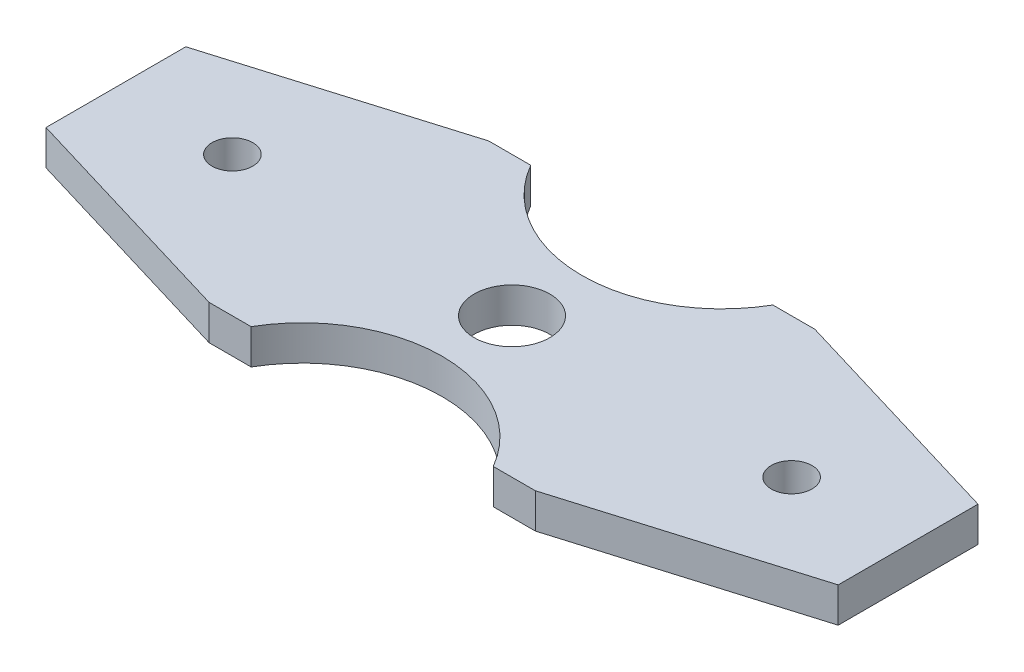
from build123d import *

# Parameters (mm, degrees)
SKETCH1_R      = 3.25
SKETCH1_R_2    = 1.75
EXTRUDE1_DEPTH = 3


with BuildPart() as part:
    # Sketch1 → Extrude1 (new body)
    with BuildSketch(Plane(origin=(0, 0, 0), x_dir=(1, 0, 0), z_dir=(0, 1, 0))):
        with BuildLine():
            Line((44.392304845, 24), (48, 24))
            Line((48, 24), (68, 18))
            Line((68, 18), (68, 6))
            Line((68, 6), (48, 0))
            Line((48, 0), (44.392304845, 0))
            ThreePointArc((44.392304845, 0), (34, 6), (23.607695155, 0))
            Line((23.607695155, 0), (20, 0))
            Line((20, 0), (0, 6))
            Line((0, 6), (0, 18))
            Line((0, 18), (20, 24))
            Line((20, 24), (23.607695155, 24))
            ThreePointArc((23.607695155, 24), (34, 18), (44.392304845, 24))
        make_face()
        with Locations(Location((34, 12, 0), (0, 0, 270))):
            Circle(SKETCH1_R, mode=Mode.SUBTRACT)
        with Locations(Location((10, 12, 0), (0, 0, 270))):
            Circle(SKETCH1_R_2, mode=Mode.SUBTRACT)
        with Locations(Location((58, 12, 0), (0, 0, 270))):
            Circle(SKETCH1_R_2, mode=Mode.SUBTRACT)
    extrude(amount=EXTRUDE1_DEPTH)


solid = part.part
